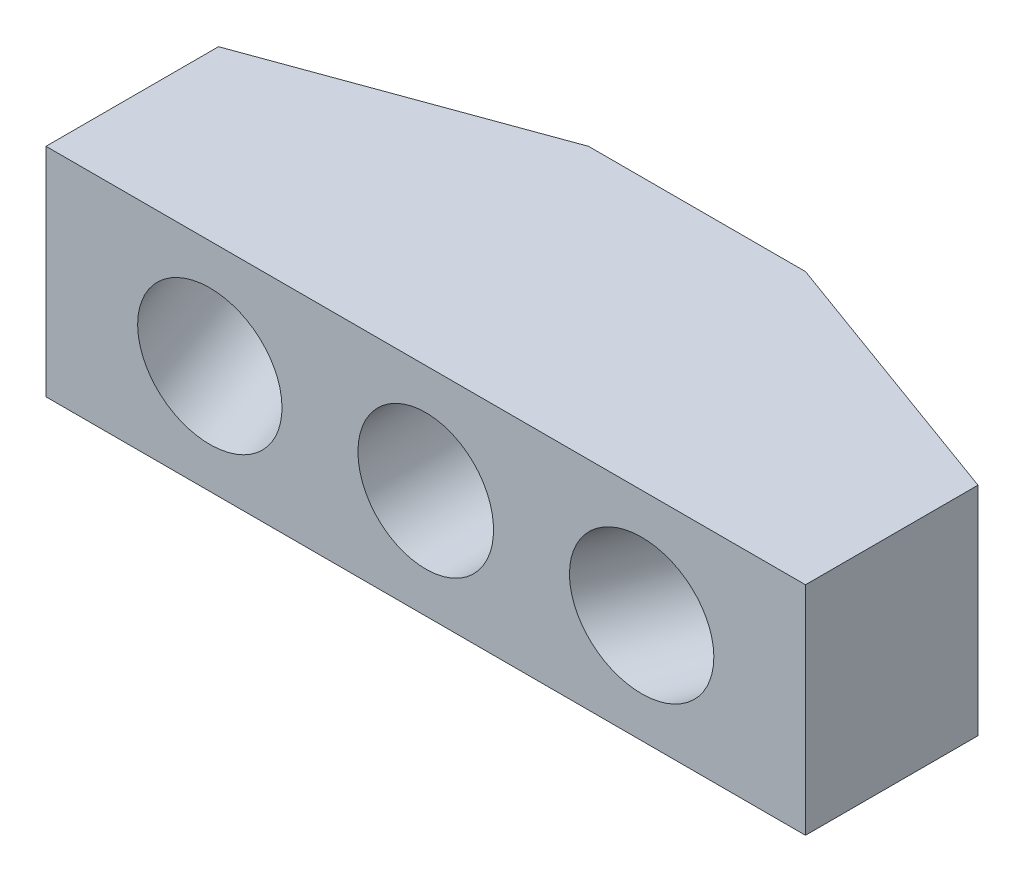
from build123d import *

# Parameters (mm, degrees)
EXTRUDE_1_DEPTH    = 4
HOLE_WIZARD_M6_1_D = 5
HOLE_WIZARD_M6_2_D = 5


with BuildPart() as part:
    # Sketch 1 → Extrude 1 (new, symmetric)
    with BuildSketch(Plane(origin=(0, 0, 0), x_dir=(1, 0, 0), z_dir=(0, 1, 0))):
        Polygon((4, 6.659010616), (-4, 6.659010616), (-14, 3.019308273), (-14, -3.340989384), (14, -3.340989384), (14, 3.019308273), align=None)
    extrude(amount=EXTRUDE_1_DEPTH, both=True)

    # Hole Wizard M6 _1 (through all)
    with Locations(Plane(origin=(0, 0, -6.659010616), x_dir=(-1, 0, 0), z_dir=(0, 0, -1))):
        with Locations((0, 0)):
            Hole(HOLE_WIZARD_M6_1_D / 2)

    # Hole Wizard M6 _2 (through all)
    with Locations(Plane(origin=(-2.608075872, 0, -7.165629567), x_dir=(-0.9396926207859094, 0, 0.34202014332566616), z_dir=(-0.34202014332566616, 0, -0.9396926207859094))):
        with Locations((8.623032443, 0)):
            hole_wizard_m6_2 = Hole(HOLE_WIZARD_M6_2_D / 2)

    # Mirror 2: Hole Wizard M6 _2 across plane
    add(hole_wizard_m6_2.mirror(Plane(origin=(0, 0, 0), x_dir=(0, 0, 1), z_dir=(1, 0, 0))), mode=Mode.SUBTRACT)


solid = part.part
